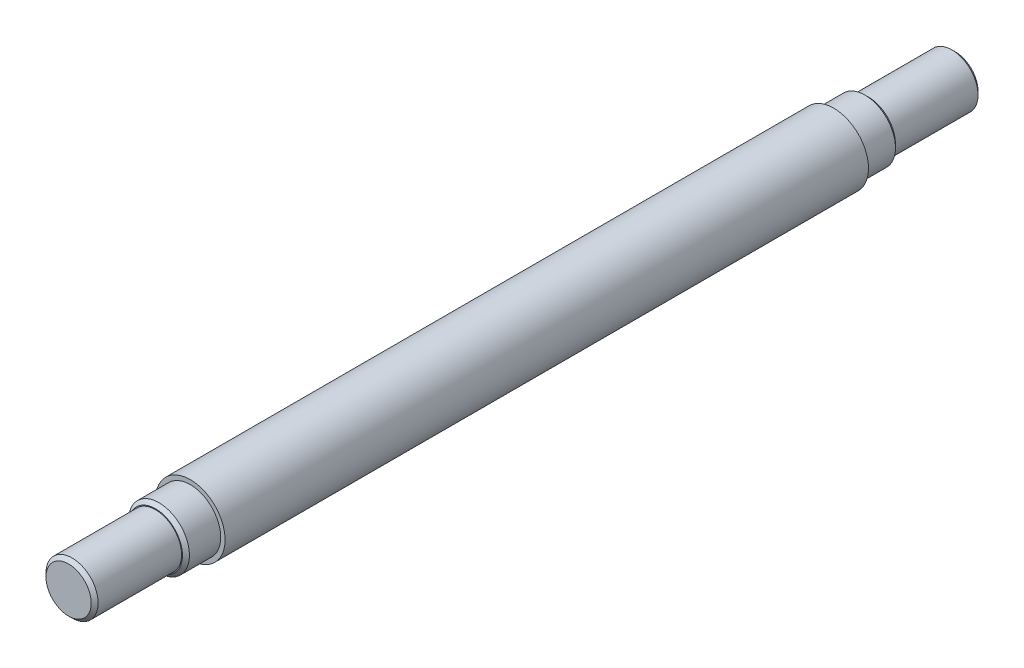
ISO-10303-21;
HEADER;
FILE_DESCRIPTION(('STEP AP214'),'2;1');
FILE_NAME('part.step','',(''),(''),'','','');
FILE_SCHEMA(('AUTOMOTIVE_DESIGN { 1 0 10303 214 1 1 1 1 }'));
ENDSEC;
DATA;
#1=APPLICATION_CONTEXT('core data for automotive mechanical design processes');
#2=APPLICATION_PROTOCOL_DEFINITION('international standard','automotive_design',2000,#1);
#3=PRODUCT_CONTEXT('',#1,'mechanical');
#4=PRODUCT('Part','Part','',(#3));
#5=PRODUCT_RELATED_PRODUCT_CATEGORY('part','',(#4));
#6=PRODUCT_DEFINITION_FORMATION('','',#4);
#7=PRODUCT_DEFINITION_CONTEXT('part definition',#1,'design');
#8=PRODUCT_DEFINITION('design','',#6,#7);
#9=PRODUCT_DEFINITION_SHAPE('','',#8);
#10=(LENGTH_UNIT() NAMED_UNIT(*) SI_UNIT(.MILLI.,.METRE.));
#11=(NAMED_UNIT(*) PLANE_ANGLE_UNIT() SI_UNIT($,.RADIAN.));
#12=(NAMED_UNIT(*) SI_UNIT($,.STERADIAN.) SOLID_ANGLE_UNIT());
#13=UNCERTAINTY_MEASURE_WITH_UNIT(LENGTH_MEASURE(1.E-05),#10,'distance_accuracy_value','');
#14=(GEOMETRIC_REPRESENTATION_CONTEXT(3) GLOBAL_UNCERTAINTY_ASSIGNED_CONTEXT((#13)) GLOBAL_UNIT_ASSIGNED_CONTEXT((#10,
#11,#12)) REPRESENTATION_CONTEXT('',''));
#15=CARTESIAN_POINT('',(0.,0.,0.));
#16=DIRECTION('',(0.,0.,1.));
#17=DIRECTION('',(1.,0.,0.));
#18=AXIS2_PLACEMENT_3D('',#15,#16,#17);
#19=CARTESIAN_POINT('',(0.,0.,370.));
#20=DIRECTION('',(0.,0.,-1.));
#21=DIRECTION('',(-1.,0.,0.));
#22=AXIS2_PLACEMENT_3D('',#19,#20,#21);
#23=CYLINDRICAL_SURFACE('',#22,20.);
#24=CARTESIAN_POINT('',(0.,0.,370.));
#25=DIRECTION('',(0.,0.,1.));
#26=DIRECTION('',(1.,0.,0.));
#27=AXIS2_PLACEMENT_3D('',#24,#25,#26);
#28=CIRCLE('',#27,20.);
#29=CARTESIAN_POINT('',(20.,0.,370.));
#30=VERTEX_POINT('',#29);
#31=EDGE_CURVE('E70',#30,#30,#28,.T.);
#32=ORIENTED_EDGE('',*,*,#31,.F.);
#33=EDGE_LOOP('',(#32));
#34=FACE_BOUND('',#33,.T.);
#35=CARTESIAN_POINT('',(0.,0.,0.));
#36=DIRECTION('',(0.,0.,1.));
#37=DIRECTION('',(1.,0.,0.));
#38=AXIS2_PLACEMENT_3D('',#35,#36,#37);
#39=CIRCLE('',#38,20.);
#40=CARTESIAN_POINT('',(20.,0.,0.));
#41=VERTEX_POINT('',#40);
#42=EDGE_CURVE('E71',#41,#41,#39,.T.);
#43=ORIENTED_EDGE('',*,*,#42,.T.);
#44=EDGE_LOOP('',(#43));
#45=FACE_BOUND('',#44,.T.);
#46=ADVANCED_FACE('F35',(#34,#45),#23,.T.);
#47=CARTESIAN_POINT('',(0.,0.,370.));
#48=DIRECTION('',(0.,0.,1.));
#49=DIRECTION('',(1.,0.,0.));
#50=AXIS2_PLACEMENT_3D('',#47,#48,#49);
#51=PLANE('',#50);
#52=CARTESIAN_POINT('',(0.,0.,370.));
#53=DIRECTION('',(0.,0.,1.));
#54=DIRECTION('',(1.,0.,0.));
#55=AXIS2_PLACEMENT_3D('',#52,#53,#54);
#56=CIRCLE('',#55,17.5);
#57=CARTESIAN_POINT('',(17.5,0.,370.));
#58=VERTEX_POINT('',#57);
#59=EDGE_CURVE('E74',#58,#58,#56,.T.);
#60=ORIENTED_EDGE('',*,*,#59,.F.);
#61=EDGE_LOOP('',(#60));
#62=FACE_BOUND('',#61,.T.);
#63=ORIENTED_EDGE('',*,*,#31,.T.);
#64=EDGE_LOOP('',(#63));
#65=FACE_BOUND('',#64,.T.);
#66=ADVANCED_FACE('F105',(#62,#65),#51,.T.);
#67=CARTESIAN_POINT('',(0.,0.,0.));
#68=DIRECTION('',(0.,0.,1.));
#69=DIRECTION('',(1.,0.,0.));
#70=AXIS2_PLACEMENT_3D('',#67,#68,#69);
#71=PLANE('',#70);
#72=CARTESIAN_POINT('',(0.,0.,0.));
#73=DIRECTION('',(0.,0.,1.));
#74=DIRECTION('',(1.,0.,0.));
#75=AXIS2_PLACEMENT_3D('',#72,#73,#74);
#76=CIRCLE('',#75,17.5);
#77=CARTESIAN_POINT('',(17.5,0.,0.));
#78=VERTEX_POINT('',#77);
#79=EDGE_CURVE('E67',#78,#78,#76,.F.);
#80=ORIENTED_EDGE('',*,*,#79,.F.);
#81=EDGE_LOOP('',(#80));
#82=FACE_BOUND('',#81,.T.);
#83=ORIENTED_EDGE('',*,*,#42,.F.);
#84=EDGE_LOOP('',(#83));
#85=FACE_BOUND('',#84,.T.);
#86=ADVANCED_FACE('F112',(#82,#85),#71,.F.);
#87=CARTESIAN_POINT('',(0.,0.,390.));
#88=DIRECTION('',(0.,0.,-1.));
#89=DIRECTION('',(-1.,0.,0.));
#90=AXIS2_PLACEMENT_3D('',#87,#88,#89);
#91=CYLINDRICAL_SURFACE('',#90,17.5);
#92=CARTESIAN_POINT('',(0.,0.,388.));
#93=DIRECTION('',(0.,0.,1.));
#94=DIRECTION('',(1.,0.,0.));
#95=AXIS2_PLACEMENT_3D('',#92,#93,#94);
#96=CIRCLE('',#95,17.5);
#97=CARTESIAN_POINT('',(17.5,0.,388.));
#98=VERTEX_POINT('',#97);
#99=EDGE_CURVE('E61',#98,#98,#96,.F.);
#100=ORIENTED_EDGE('',*,*,#99,.T.);
#101=EDGE_LOOP('',(#100));
#102=FACE_BOUND('',#101,.T.);
#103=ORIENTED_EDGE('',*,*,#59,.T.);
#104=EDGE_LOOP('',(#103));
#105=FACE_BOUND('',#104,.T.);
#106=ADVANCED_FACE('F209',(#102,#105),#91,.T.);
#107=CARTESIAN_POINT('',(0.,0.,390.));
#108=DIRECTION('',(0.,0.,1.));
#109=DIRECTION('',(1.,0.,0.));
#110=AXIS2_PLACEMENT_3D('',#107,#108,#109);
#111=PLANE('',#110);
#112=CARTESIAN_POINT('',(0.,0.,390.));
#113=DIRECTION('',(0.,0.,1.));
#114=DIRECTION('',(1.,0.,0.));
#115=AXIS2_PLACEMENT_3D('',#112,#113,#114);
#116=CIRCLE('',#115,15.5);
#117=CARTESIAN_POINT('',(15.5,0.,390.));
#118=VERTEX_POINT('',#117);
#119=EDGE_CURVE('E64',#118,#118,#116,.T.);
#120=ORIENTED_EDGE('',*,*,#119,.T.);
#121=EDGE_LOOP('',(#120));
#122=FACE_BOUND('',#121,.T.);
#123=CARTESIAN_POINT('',(0.,0.,390.));
#124=DIRECTION('',(0.,0.,1.));
#125=DIRECTION('',(1.,0.,0.));
#126=AXIS2_PLACEMENT_3D('',#123,#124,#125);
#127=CIRCLE('',#126,15.);
#128=CARTESIAN_POINT('',(15.,0.,390.));
#129=VERTEX_POINT('',#128);
#130=EDGE_CURVE('E79',#129,#129,#127,.T.);
#131=ORIENTED_EDGE('',*,*,#130,.F.);
#132=EDGE_LOOP('',(#131));
#133=FACE_BOUND('',#132,.T.);
#134=ADVANCED_FACE('F101',(#122,#133),#111,.T.);
#135=CARTESIAN_POINT('',(0.,0.,-20.));
#136=DIRECTION('',(0.,0.,1.));
#137=DIRECTION('',(1.,0.,0.));
#138=AXIS2_PLACEMENT_3D('',#135,#136,#137);
#139=CYLINDRICAL_SURFACE('',#138,17.5);
#140=CARTESIAN_POINT('',(0.,0.,-18.));
#141=DIRECTION('',(0.,0.,-1.));
#142=DIRECTION('',(-1.,0.,0.));
#143=AXIS2_PLACEMENT_3D('',#140,#141,#142);
#144=CIRCLE('',#143,17.5);
#145=CARTESIAN_POINT('',(-17.5,0.,-18.));
#146=VERTEX_POINT('',#145);
#147=EDGE_CURVE('E55',#146,#146,#144,.F.);
#148=ORIENTED_EDGE('',*,*,#147,.T.);
#149=EDGE_LOOP('',(#148));
#150=FACE_BOUND('',#149,.T.);
#151=ORIENTED_EDGE('',*,*,#79,.T.);
#152=EDGE_LOOP('',(#151));
#153=FACE_BOUND('',#152,.T.);
#154=ADVANCED_FACE('F91',(#150,#153),#139,.T.);
#155=CARTESIAN_POINT('',(0.,0.,-20.));
#156=DIRECTION('',(0.,0.,-1.));
#157=DIRECTION('',(-1.,0.,0.));
#158=AXIS2_PLACEMENT_3D('',#155,#156,#157);
#159=PLANE('',#158);
#160=CARTESIAN_POINT('',(0.,0.,-20.));
#161=DIRECTION('',(0.,0.,-1.));
#162=DIRECTION('',(-1.,0.,0.));
#163=AXIS2_PLACEMENT_3D('',#160,#161,#162);
#164=CIRCLE('',#163,15.5);
#165=CARTESIAN_POINT('',(-15.5,0.,-20.));
#166=VERTEX_POINT('',#165);
#167=EDGE_CURVE('E58',#166,#166,#164,.T.);
#168=ORIENTED_EDGE('',*,*,#167,.T.);
#169=EDGE_LOOP('',(#168));
#170=FACE_BOUND('',#169,.T.);
#171=CARTESIAN_POINT('',(0.,0.,-20.));
#172=DIRECTION('',(0.,0.,-1.));
#173=DIRECTION('',(-1.,0.,0.));
#174=AXIS2_PLACEMENT_3D('',#171,#172,#173);
#175=CIRCLE('',#174,15.);
#176=CARTESIAN_POINT('',(-15.,0.,-20.));
#177=VERTEX_POINT('',#176);
#178=EDGE_CURVE('E82',#177,#177,#175,.T.);
#179=ORIENTED_EDGE('',*,*,#178,.F.);
#180=EDGE_LOOP('',(#179));
#181=FACE_BOUND('',#180,.T.);
#182=ADVANCED_FACE('F88',(#170,#181),#159,.T.);
#183=CARTESIAN_POINT('',(0.,0.,440.));
#184=DIRECTION('',(0.,0.,-1.));
#185=DIRECTION('',(-1.,0.,0.));
#186=AXIS2_PLACEMENT_3D('',#183,#184,#185);
#187=CYLINDRICAL_SURFACE('',#186,15.);
#188=CARTESIAN_POINT('',(0.,0.,438.));
#189=DIRECTION('',(0.,0.,1.));
#190=DIRECTION('',(1.,0.,0.));
#191=AXIS2_PLACEMENT_3D('',#188,#189,#190);
#192=CIRCLE('',#191,15.);
#193=CARTESIAN_POINT('',(15.,0.,438.));
#194=VERTEX_POINT('',#193);
#195=EDGE_CURVE('E10',#194,#194,#192,.F.);
#196=ORIENTED_EDGE('',*,*,#195,.T.);
#197=EDGE_LOOP('',(#196));
#198=FACE_BOUND('',#197,.T.);
#199=ORIENTED_EDGE('',*,*,#130,.T.);
#200=EDGE_LOOP('',(#199));
#201=FACE_BOUND('',#200,.T.);
#202=ADVANCED_FACE('F90',(#198,#201),#187,.T.);
#203=CARTESIAN_POINT('',(0.,0.,440.));
#204=DIRECTION('',(0.,0.,1.));
#205=DIRECTION('',(1.,0.,0.));
#206=AXIS2_PLACEMENT_3D('',#203,#204,#205);
#207=PLANE('',#206);
#208=CARTESIAN_POINT('',(0.,0.,440.));
#209=DIRECTION('',(0.,0.,1.));
#210=DIRECTION('',(1.,0.,0.));
#211=AXIS2_PLACEMENT_3D('',#208,#209,#210);
#212=CIRCLE('',#211,13.0000000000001);
#213=CARTESIAN_POINT('',(13.0000000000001,0.,440.));
#214=VERTEX_POINT('',#213);
#215=EDGE_CURVE('E42',#214,#214,#212,.T.);
#216=ORIENTED_EDGE('',*,*,#215,.T.);
#217=EDGE_LOOP('',(#216));
#218=FACE_BOUND('',#217,.T.);
#219=ADVANCED_FACE('F99',(#218),#207,.T.);
#220=CARTESIAN_POINT('',(0.,0.,-70.));
#221=DIRECTION('',(0.,0.,1.));
#222=DIRECTION('',(1.,0.,0.));
#223=AXIS2_PLACEMENT_3D('',#220,#221,#222);
#224=CYLINDRICAL_SURFACE('',#223,15.);
#225=CARTESIAN_POINT('',(0.,0.,-68.0000000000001));
#226=DIRECTION('',(0.,0.,-1.));
#227=DIRECTION('',(-1.,0.,0.));
#228=AXIS2_PLACEMENT_3D('',#225,#226,#227);
#229=CIRCLE('',#228,15.);
#230=CARTESIAN_POINT('',(-15.,0.,-68.0000000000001));
#231=VERTEX_POINT('',#230);
#232=EDGE_CURVE('E46',#231,#231,#229,.F.);
#233=ORIENTED_EDGE('',*,*,#232,.T.);
#234=EDGE_LOOP('',(#233));
#235=FACE_BOUND('',#234,.T.);
#236=ORIENTED_EDGE('',*,*,#178,.T.);
#237=EDGE_LOOP('',(#236));
#238=FACE_BOUND('',#237,.T.);
#239=ADVANCED_FACE('F86',(#235,#238),#224,.T.);
#240=CARTESIAN_POINT('',(0.,0.,-70.));
#241=DIRECTION('',(0.,0.,-1.));
#242=DIRECTION('',(-1.,0.,0.));
#243=AXIS2_PLACEMENT_3D('',#240,#241,#242);
#244=PLANE('',#243);
#245=CARTESIAN_POINT('',(0.,0.,-70.));
#246=DIRECTION('',(0.,0.,-1.));
#247=DIRECTION('',(-1.,0.,0.));
#248=AXIS2_PLACEMENT_3D('',#245,#246,#247);
#249=CIRCLE('',#248,13.0000000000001);
#250=CARTESIAN_POINT('',(-13.0000000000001,0.,-70.));
#251=VERTEX_POINT('',#250);
#252=EDGE_CURVE('E50',#251,#251,#249,.T.);
#253=ORIENTED_EDGE('',*,*,#252,.T.);
#254=EDGE_LOOP('',(#253));
#255=FACE_BOUND('',#254,.T.);
#256=ADVANCED_FACE('F123',(#255),#244,.T.);
#257=CARTESIAN_POINT('',(0.,0.,390.));
#258=DIRECTION('',(0.,0.,-1.));
#259=DIRECTION('',(-1.,0.,0.));
#260=AXIS2_PLACEMENT_3D('',#257,#258,#259);
#261=CONICAL_SURFACE('',#260,15.5,0.785398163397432);
#262=ORIENTED_EDGE('',*,*,#99,.F.);
#263=EDGE_LOOP('',(#262));
#264=FACE_BOUND('',#263,.T.);
#265=ORIENTED_EDGE('',*,*,#119,.F.);
#266=EDGE_LOOP('',(#265));
#267=FACE_BOUND('',#266,.T.);
#268=ADVANCED_FACE('F119',(#264,#267),#261,.T.);
#269=CARTESIAN_POINT('',(0.,0.,-20.));
#270=DIRECTION('',(0.,0.,1.));
#271=DIRECTION('',(1.,0.,0.));
#272=AXIS2_PLACEMENT_3D('',#269,#270,#271);
#273=CONICAL_SURFACE('',#272,15.5,0.785398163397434);
#274=ORIENTED_EDGE('',*,*,#147,.F.);
#275=EDGE_LOOP('',(#274));
#276=FACE_BOUND('',#275,.T.);
#277=ORIENTED_EDGE('',*,*,#167,.F.);
#278=EDGE_LOOP('',(#277));
#279=FACE_BOUND('',#278,.T.);
#280=ADVANCED_FACE('F122',(#276,#279),#273,.T.);
#281=CARTESIAN_POINT('',(0.,0.,-70.));
#282=DIRECTION('',(0.,0.,1.));
#283=DIRECTION('',(1.,0.,0.));
#284=AXIS2_PLACEMENT_3D('',#281,#282,#283);
#285=CONICAL_SURFACE('',#284,13.0000000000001,0.785398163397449);
#286=ORIENTED_EDGE('',*,*,#232,.F.);
#287=EDGE_LOOP('',(#286));
#288=FACE_BOUND('',#287,.T.);
#289=ORIENTED_EDGE('',*,*,#252,.F.);
#290=EDGE_LOOP('',(#289));
#291=FACE_BOUND('',#290,.T.);
#292=ADVANCED_FACE('F126',(#288,#291),#285,.T.);
#293=CARTESIAN_POINT('',(0.,0.,440.));
#294=DIRECTION('',(0.,0.,-1.));
#295=DIRECTION('',(-1.,0.,0.));
#296=AXIS2_PLACEMENT_3D('',#293,#294,#295);
#297=CONICAL_SURFACE('',#296,13.0000000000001,0.785398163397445);
#298=ORIENTED_EDGE('',*,*,#195,.F.);
#299=EDGE_LOOP('',(#298));
#300=FACE_BOUND('',#299,.T.);
#301=ORIENTED_EDGE('',*,*,#215,.F.);
#302=EDGE_LOOP('',(#301));
#303=FACE_BOUND('',#302,.T.);
#304=ADVANCED_FACE('F37',(#300,#303),#297,.T.);
#305=CLOSED_SHELL('',(#46,#66,#86,#106,#134,#154,#182,#202,#219,#239,#256,#268,#280,#292,#304));
#306=MANIFOLD_SOLID_BREP('B2',#305);
#307=ADVANCED_BREP_SHAPE_REPRESENTATION('',(#18,#306),#14);
#308=SHAPE_DEFINITION_REPRESENTATION(#9,#307);
ENDSEC;
END-ISO-10303-21;
